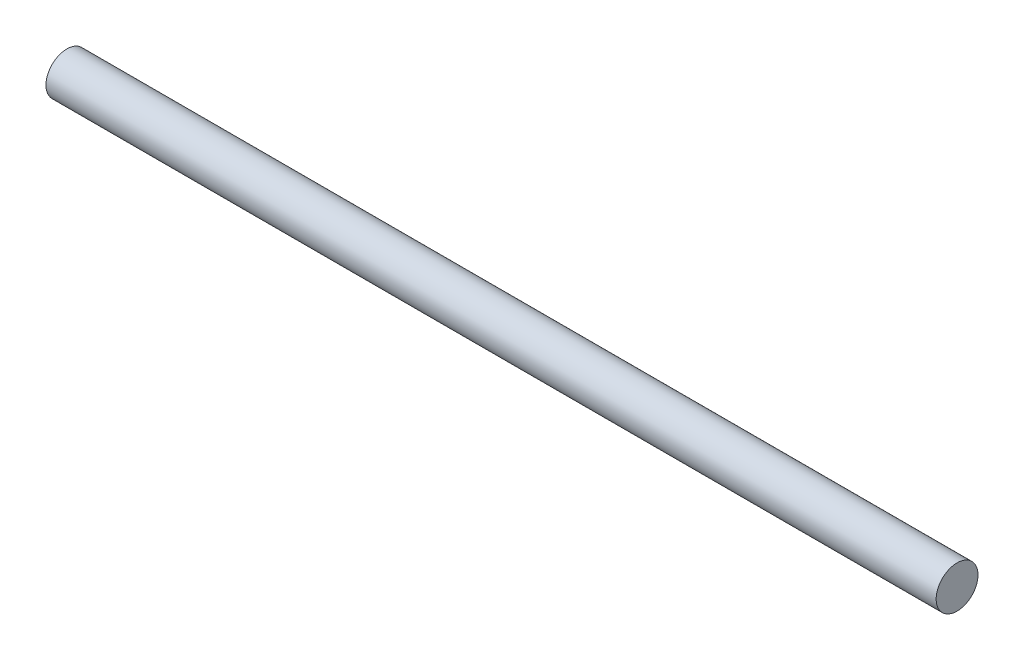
ISO-10303-21;
HEADER;
FILE_DESCRIPTION(('STEP AP214'),'2;1');
FILE_NAME('part.step','',(''),(''),'','','');
FILE_SCHEMA(('AUTOMOTIVE_DESIGN { 1 0 10303 214 1 1 1 1 }'));
ENDSEC;
DATA;
#1=APPLICATION_CONTEXT('core data for automotive mechanical design processes');
#2=APPLICATION_PROTOCOL_DEFINITION('international standard','automotive_design',2000,#1);
#3=PRODUCT_CONTEXT('',#1,'mechanical');
#4=PRODUCT('Part','Part','',(#3));
#5=PRODUCT_RELATED_PRODUCT_CATEGORY('part','',(#4));
#6=PRODUCT_DEFINITION_FORMATION('','',#4);
#7=PRODUCT_DEFINITION_CONTEXT('part definition',#1,'design');
#8=PRODUCT_DEFINITION('design','',#6,#7);
#9=PRODUCT_DEFINITION_SHAPE('','',#8);
#10=(LENGTH_UNIT() NAMED_UNIT(*) SI_UNIT(.MILLI.,.METRE.));
#11=(NAMED_UNIT(*) PLANE_ANGLE_UNIT() SI_UNIT($,.RADIAN.));
#12=(NAMED_UNIT(*) SI_UNIT($,.STERADIAN.) SOLID_ANGLE_UNIT());
#13=UNCERTAINTY_MEASURE_WITH_UNIT(LENGTH_MEASURE(1.E-05),#10,'distance_accuracy_value','');
#14=(GEOMETRIC_REPRESENTATION_CONTEXT(3) GLOBAL_UNCERTAINTY_ASSIGNED_CONTEXT((#13)) GLOBAL_UNIT_ASSIGNED_CONTEXT((#10,
#11,#12)) REPRESENTATION_CONTEXT('',''));
#15=CARTESIAN_POINT('',(0.,0.,0.));
#16=DIRECTION('',(0.,0.,1.));
#17=DIRECTION('',(1.,0.,0.));
#18=AXIS2_PLACEMENT_3D('',#15,#16,#17);
#19=CARTESIAN_POINT('',(-79.6567727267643,0.,0.));
#20=DIRECTION('',(1.,0.,0.));
#21=DIRECTION('',(0.,0.,-1.));
#22=AXIS2_PLACEMENT_3D('',#19,#20,#21);
#23=CYLINDRICAL_SURFACE('',#22,1.575);
#24=CARTESIAN_POINT('',(-79.6567727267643,0.,0.));
#25=DIRECTION('',(1.,0.,0.));
#26=DIRECTION('',(0.,0.,-1.));
#27=AXIS2_PLACEMENT_3D('',#24,#25,#26);
#28=CIRCLE('',#27,1.575);
#29=CARTESIAN_POINT('',(-79.6567727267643,0.,-1.575));
#30=VERTEX_POINT('',#29);
#31=EDGE_CURVE('E10',#30,#30,#28,.T.);
#32=ORIENTED_EDGE('',*,*,#31,.T.);
#33=EDGE_LOOP('',(#32));
#34=FACE_BOUND('',#33,.T.);
#35=CARTESIAN_POINT('',(-12.6567727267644,0.,0.));
#36=DIRECTION('',(1.,0.,0.));
#37=DIRECTION('',(0.,0.,-1.));
#38=AXIS2_PLACEMENT_3D('',#35,#36,#37);
#39=CIRCLE('',#38,1.575);
#40=CARTESIAN_POINT('',(-12.6567727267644,0.,-1.575));
#41=VERTEX_POINT('',#40);
#42=EDGE_CURVE('E31',#41,#41,#39,.T.);
#43=ORIENTED_EDGE('',*,*,#42,.F.);
#44=EDGE_LOOP('',(#43));
#45=FACE_BOUND('',#44,.T.);
#46=ADVANCED_FACE('F28',(#34,#45),#23,.T.);
#47=CARTESIAN_POINT('',(-79.6567727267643,0.,0.));
#48=DIRECTION('',(1.,0.,0.));
#49=DIRECTION('',(0.,0.,-1.));
#50=AXIS2_PLACEMENT_3D('',#47,#48,#49);
#51=PLANE('',#50);
#52=ORIENTED_EDGE('',*,*,#31,.F.);
#53=EDGE_LOOP('',(#52));
#54=FACE_BOUND('',#53,.T.);
#55=ADVANCED_FACE('F43',(#54),#51,.F.);
#56=CARTESIAN_POINT('',(-12.6567727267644,0.,0.));
#57=DIRECTION('',(1.,0.,0.));
#58=DIRECTION('',(0.,0.,-1.));
#59=AXIS2_PLACEMENT_3D('',#56,#57,#58);
#60=PLANE('',#59);
#61=ORIENTED_EDGE('',*,*,#42,.T.);
#62=EDGE_LOOP('',(#61));
#63=FACE_BOUND('',#62,.T.);
#64=ADVANCED_FACE('F40',(#63),#60,.T.);
#65=CLOSED_SHELL('',(#46,#55,#64));
#66=MANIFOLD_SOLID_BREP('B2',#65);
#67=ADVANCED_BREP_SHAPE_REPRESENTATION('',(#18,#66),#14);
#68=SHAPE_DEFINITION_REPRESENTATION(#9,#67);
ENDSEC;
END-ISO-10303-21;
